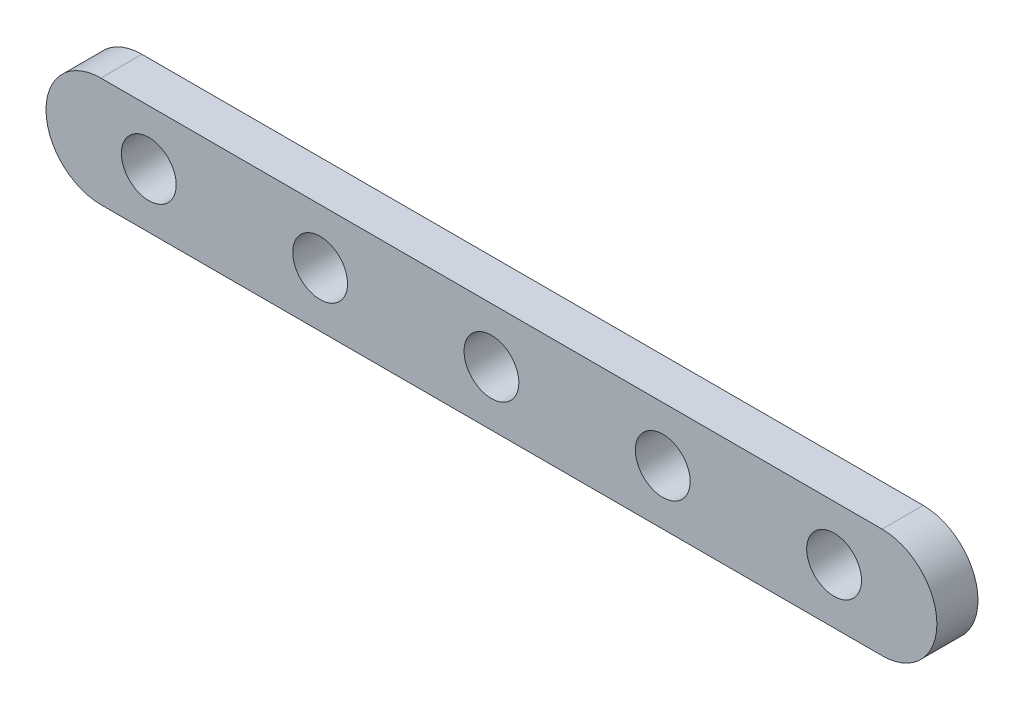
ISO-10303-21;
HEADER;
FILE_DESCRIPTION(('STEP AP214'),'2;1');
FILE_NAME('part.step','',(''),(''),'','','');
FILE_SCHEMA(('AUTOMOTIVE_DESIGN { 1 0 10303 214 1 1 1 1 }'));
ENDSEC;
DATA;
#1=APPLICATION_CONTEXT('core data for automotive mechanical design processes');
#2=APPLICATION_PROTOCOL_DEFINITION('international standard','automotive_design',2000,#1);
#3=PRODUCT_CONTEXT('',#1,'mechanical');
#4=PRODUCT('Part','Part','',(#3));
#5=PRODUCT_RELATED_PRODUCT_CATEGORY('part','',(#4));
#6=PRODUCT_DEFINITION_FORMATION('','',#4);
#7=PRODUCT_DEFINITION_CONTEXT('part definition',#1,'design');
#8=PRODUCT_DEFINITION('design','',#6,#7);
#9=PRODUCT_DEFINITION_SHAPE('','',#8);
#10=(LENGTH_UNIT() NAMED_UNIT(*) SI_UNIT(.MILLI.,.METRE.));
#11=(NAMED_UNIT(*) PLANE_ANGLE_UNIT() SI_UNIT($,.RADIAN.));
#12=(NAMED_UNIT(*) SI_UNIT($,.STERADIAN.) SOLID_ANGLE_UNIT());
#13=UNCERTAINTY_MEASURE_WITH_UNIT(LENGTH_MEASURE(1.E-05),#10,'distance_accuracy_value','');
#14=(GEOMETRIC_REPRESENTATION_CONTEXT(3) GLOBAL_UNCERTAINTY_ASSIGNED_CONTEXT((#13)) GLOBAL_UNIT_ASSIGNED_CONTEXT((#10,
#11,#12)) REPRESENTATION_CONTEXT('',''));
#15=CARTESIAN_POINT('',(0.,0.,0.));
#16=DIRECTION('',(0.,0.,1.));
#17=DIRECTION('',(1.,0.,0.));
#18=AXIS2_PLACEMENT_3D('',#15,#16,#17);
#19=CARTESIAN_POINT('',(-28.5,0.,3.));
#20=DIRECTION('',(0.,0.,1.));
#21=DIRECTION('',(1.,0.,0.));
#22=AXIS2_PLACEMENT_3D('',#19,#20,#21);
#23=PLANE('',#22);
#24=CARTESIAN_POINT('',(12.5,0.,3.));
#25=DIRECTION('',(0.,0.,1.));
#26=DIRECTION('',(1.,0.,0.));
#27=AXIS2_PLACEMENT_3D('',#24,#25,#26);
#28=CIRCLE('',#27,2.);
#29=CARTESIAN_POINT('',(14.5,0.,3.));
#30=VERTEX_POINT('',#29);
#31=EDGE_CURVE('E126',#30,#30,#28,.T.);
#32=ORIENTED_EDGE('',*,*,#31,.F.);
#33=EDGE_LOOP('',(#32));
#34=FACE_BOUND('',#33,.T.);
#35=CARTESIAN_POINT('',(-12.5,0.,3.));
#36=DIRECTION('',(0.,0.,1.));
#37=DIRECTION('',(1.,0.,0.));
#38=AXIS2_PLACEMENT_3D('',#35,#36,#37);
#39=CIRCLE('',#38,2.);
#40=CARTESIAN_POINT('',(-10.5,0.,3.));
#41=VERTEX_POINT('',#40);
#42=EDGE_CURVE('E114',#41,#41,#39,.T.);
#43=ORIENTED_EDGE('',*,*,#42,.F.);
#44=EDGE_LOOP('',(#43));
#45=FACE_BOUND('',#44,.T.);
#46=CARTESIAN_POINT('',(-28.5,0.,3.));
#47=DIRECTION('',(0.,0.,1.));
#48=DIRECTION('',(1.,0.,0.));
#49=AXIS2_PLACEMENT_3D('',#46,#47,#48);
#50=CIRCLE('',#49,4.);
#51=CARTESIAN_POINT('',(-28.5,3.99999999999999,3.));
#52=VERTEX_POINT('',#51);
#53=CARTESIAN_POINT('',(-28.5,-4.,3.));
#54=VERTEX_POINT('',#53);
#55=EDGE_CURVE('E76',#52,#54,#50,.T.);
#56=ORIENTED_EDGE('',*,*,#55,.T.);
#57=DIRECTION('',(-1.,0.,0.));
#58=VECTOR('',#57,1.);
#59=CARTESIAN_POINT('',(28.5,-4.,3.));
#60=LINE('',#59,#58);
#61=CARTESIAN_POINT('',(28.5,-4.,3.));
#62=VERTEX_POINT('',#61);
#63=EDGE_CURVE('E83',#62,#54,#60,.T.);
#64=ORIENTED_EDGE('',*,*,#63,.F.);
#65=CARTESIAN_POINT('',(28.5,0.,3.));
#66=DIRECTION('',(0.,0.,-1.));
#67=DIRECTION('',(-1.,0.,0.));
#68=AXIS2_PLACEMENT_3D('',#65,#66,#67);
#69=CIRCLE('',#68,3.99999999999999);
#70=CARTESIAN_POINT('',(28.5,3.99999999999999,3.));
#71=VERTEX_POINT('',#70);
#72=EDGE_CURVE('E91',#71,#62,#69,.T.);
#73=ORIENTED_EDGE('',*,*,#72,.F.);
#74=DIRECTION('',(1.,0.,0.));
#75=VECTOR('',#74,1.);
#76=CARTESIAN_POINT('',(-28.5,3.99999999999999,3.));
#77=LINE('',#76,#75);
#78=EDGE_CURVE('E94',#52,#71,#77,.T.);
#79=ORIENTED_EDGE('',*,*,#78,.F.);
#80=EDGE_LOOP('',(#56,#64,#73,#79));
#81=FACE_BOUND('',#80,.T.);
#82=CARTESIAN_POINT('',(-25.,0.,3.));
#83=DIRECTION('',(0.,0.,1.));
#84=DIRECTION('',(1.,0.,0.));
#85=AXIS2_PLACEMENT_3D('',#82,#83,#84);
#86=CIRCLE('',#85,2.);
#87=CARTESIAN_POINT('',(-23.,0.,3.));
#88=VERTEX_POINT('',#87);
#89=EDGE_CURVE('E101',#88,#88,#86,.T.);
#90=ORIENTED_EDGE('',*,*,#89,.F.);
#91=EDGE_LOOP('',(#90));
#92=FACE_BOUND('',#91,.T.);
#93=CARTESIAN_POINT('',(0.,0.,3.));
#94=DIRECTION('',(0.,0.,1.));
#95=DIRECTION('',(1.,0.,0.));
#96=AXIS2_PLACEMENT_3D('',#93,#94,#95);
#97=CIRCLE('',#96,2.);
#98=CARTESIAN_POINT('',(2.,0.,3.));
#99=VERTEX_POINT('',#98);
#100=EDGE_CURVE('E120',#99,#99,#97,.T.);
#101=ORIENTED_EDGE('',*,*,#100,.F.);
#102=EDGE_LOOP('',(#101));
#103=FACE_BOUND('',#102,.T.);
#104=CARTESIAN_POINT('',(25.,0.,3.));
#105=DIRECTION('',(0.,0.,1.));
#106=DIRECTION('',(1.,0.,0.));
#107=AXIS2_PLACEMENT_3D('',#104,#105,#106);
#108=CIRCLE('',#107,2.);
#109=CARTESIAN_POINT('',(27.,0.,3.));
#110=VERTEX_POINT('',#109);
#111=EDGE_CURVE('E132',#110,#110,#108,.T.);
#112=ORIENTED_EDGE('',*,*,#111,.F.);
#113=EDGE_LOOP('',(#112));
#114=FACE_BOUND('',#113,.T.);
#115=ADVANCED_FACE('F35',(#34,#45,#81,#92,#103,#114),#23,.T.);
#116=CARTESIAN_POINT('',(-28.5,0.,0.));
#117=DIRECTION('',(0.,0.,1.));
#118=DIRECTION('',(1.,0.,0.));
#119=AXIS2_PLACEMENT_3D('',#116,#117,#118);
#120=PLANE('',#119);
#121=CARTESIAN_POINT('',(12.5,0.,0.));
#122=DIRECTION('',(0.,0.,1.));
#123=DIRECTION('',(1.,0.,0.));
#124=AXIS2_PLACEMENT_3D('',#121,#122,#123);
#125=CIRCLE('',#124,2.);
#126=CARTESIAN_POINT('',(14.5,0.,0.));
#127=VERTEX_POINT('',#126);
#128=EDGE_CURVE('E129',#127,#127,#125,.T.);
#129=ORIENTED_EDGE('',*,*,#128,.T.);
#130=EDGE_LOOP('',(#129));
#131=FACE_BOUND('',#130,.T.);
#132=CARTESIAN_POINT('',(-12.5,0.,0.));
#133=DIRECTION('',(0.,0.,1.));
#134=DIRECTION('',(1.,0.,0.));
#135=AXIS2_PLACEMENT_3D('',#132,#133,#134);
#136=CIRCLE('',#135,2.);
#137=CARTESIAN_POINT('',(-10.5,0.,0.));
#138=VERTEX_POINT('',#137);
#139=EDGE_CURVE('E117',#138,#138,#136,.T.);
#140=ORIENTED_EDGE('',*,*,#139,.T.);
#141=EDGE_LOOP('',(#140));
#142=FACE_BOUND('',#141,.T.);
#143=CARTESIAN_POINT('',(-28.5,0.,0.));
#144=DIRECTION('',(0.,0.,1.));
#145=DIRECTION('',(1.,0.,0.));
#146=AXIS2_PLACEMENT_3D('',#143,#144,#145);
#147=CIRCLE('',#146,4.);
#148=CARTESIAN_POINT('',(-28.5,3.99999999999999,0.));
#149=VERTEX_POINT('',#148);
#150=CARTESIAN_POINT('',(-28.5,-4.,0.));
#151=VERTEX_POINT('',#150);
#152=EDGE_CURVE('E99',#149,#151,#147,.T.);
#153=ORIENTED_EDGE('',*,*,#152,.F.);
#154=DIRECTION('',(1.,0.,0.));
#155=VECTOR('',#154,1.);
#156=CARTESIAN_POINT('',(-28.5,3.99999999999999,0.));
#157=LINE('',#156,#155);
#158=CARTESIAN_POINT('',(28.5,3.99999999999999,0.));
#159=VERTEX_POINT('',#158);
#160=EDGE_CURVE('E105',#149,#159,#157,.T.);
#161=ORIENTED_EDGE('',*,*,#160,.T.);
#162=CARTESIAN_POINT('',(28.5,0.,0.));
#163=DIRECTION('',(0.,0.,-1.));
#164=DIRECTION('',(-1.,0.,0.));
#165=AXIS2_PLACEMENT_3D('',#162,#163,#164);
#166=CIRCLE('',#165,3.99999999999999);
#167=CARTESIAN_POINT('',(28.5,-4.,0.));
#168=VERTEX_POINT('',#167);
#169=EDGE_CURVE('E103',#159,#168,#166,.T.);
#170=ORIENTED_EDGE('',*,*,#169,.T.);
#171=DIRECTION('',(-1.,0.,0.));
#172=VECTOR('',#171,1.);
#173=CARTESIAN_POINT('',(28.5,-4.,0.));
#174=LINE('',#173,#172);
#175=EDGE_CURVE('E85',#168,#151,#174,.T.);
#176=ORIENTED_EDGE('',*,*,#175,.T.);
#177=EDGE_LOOP('',(#153,#161,#170,#176));
#178=FACE_BOUND('',#177,.T.);
#179=CARTESIAN_POINT('',(-25.,0.,0.));
#180=DIRECTION('',(0.,0.,1.));
#181=DIRECTION('',(1.,0.,0.));
#182=AXIS2_PLACEMENT_3D('',#179,#180,#181);
#183=CIRCLE('',#182,2.);
#184=CARTESIAN_POINT('',(-23.,0.,0.));
#185=VERTEX_POINT('',#184);
#186=EDGE_CURVE('E111',#185,#185,#183,.T.);
#187=ORIENTED_EDGE('',*,*,#186,.T.);
#188=EDGE_LOOP('',(#187));
#189=FACE_BOUND('',#188,.T.);
#190=CARTESIAN_POINT('',(0.,0.,0.));
#191=DIRECTION('',(0.,0.,1.));
#192=DIRECTION('',(1.,0.,0.));
#193=AXIS2_PLACEMENT_3D('',#190,#191,#192);
#194=CIRCLE('',#193,2.);
#195=CARTESIAN_POINT('',(2.,0.,0.));
#196=VERTEX_POINT('',#195);
#197=EDGE_CURVE('E123',#196,#196,#194,.T.);
#198=ORIENTED_EDGE('',*,*,#197,.T.);
#199=EDGE_LOOP('',(#198));
#200=FACE_BOUND('',#199,.T.);
#201=CARTESIAN_POINT('',(25.,0.,0.));
#202=DIRECTION('',(0.,0.,1.));
#203=DIRECTION('',(1.,0.,0.));
#204=AXIS2_PLACEMENT_3D('',#201,#202,#203);
#205=CIRCLE('',#204,2.);
#206=CARTESIAN_POINT('',(27.,0.,0.));
#207=VERTEX_POINT('',#206);
#208=EDGE_CURVE('E135',#207,#207,#205,.T.);
#209=ORIENTED_EDGE('',*,*,#208,.T.);
#210=EDGE_LOOP('',(#209));
#211=FACE_BOUND('',#210,.T.);
#212=ADVANCED_FACE('F145',(#131,#142,#178,#189,#200,#211),#120,.F.);
#213=CARTESIAN_POINT('',(-28.5,0.,3.));
#214=DIRECTION('',(0.,0.,-1.));
#215=DIRECTION('',(-1.,0.,0.));
#216=AXIS2_PLACEMENT_3D('',#213,#214,#215);
#217=CYLINDRICAL_SURFACE('',#216,4.);
#218=ORIENTED_EDGE('',*,*,#152,.T.);
#219=DIRECTION('',(0.,0.,-1.));
#220=VECTOR('',#219,1.);
#221=CARTESIAN_POINT('',(-28.5,-4.,3.));
#222=LINE('',#221,#220);
#223=EDGE_CURVE('E11',#54,#151,#222,.T.);
#224=ORIENTED_EDGE('',*,*,#223,.F.);
#225=ORIENTED_EDGE('',*,*,#55,.F.);
#226=DIRECTION('',(0.,0.,-1.));
#227=VECTOR('',#226,1.);
#228=CARTESIAN_POINT('',(-28.5,3.99999999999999,3.));
#229=LINE('',#228,#227);
#230=EDGE_CURVE('E52',#52,#149,#229,.T.);
#231=ORIENTED_EDGE('',*,*,#230,.T.);
#232=EDGE_LOOP('',(#218,#224,#225,#231));
#233=FACE_BOUND('',#232,.T.);
#234=ADVANCED_FACE('F37',(#233),#217,.T.);
#235=CARTESIAN_POINT('',(28.5,-4.,3.));
#236=DIRECTION('',(0.,-1.,0.));
#237=DIRECTION('',(1.,0.,0.));
#238=AXIS2_PLACEMENT_3D('',#235,#236,#237);
#239=PLANE('',#238);
#240=ORIENTED_EDGE('',*,*,#175,.F.);
#241=DIRECTION('',(0.,0.,-1.));
#242=VECTOR('',#241,1.);
#243=CARTESIAN_POINT('',(28.5,-4.,3.));
#244=LINE('',#243,#242);
#245=EDGE_CURVE('E44',#62,#168,#244,.T.);
#246=ORIENTED_EDGE('',*,*,#245,.F.);
#247=ORIENTED_EDGE('',*,*,#63,.T.);
#248=ORIENTED_EDGE('',*,*,#223,.T.);
#249=EDGE_LOOP('',(#240,#246,#247,#248));
#250=FACE_BOUND('',#249,.T.);
#251=ADVANCED_FACE('F82',(#250),#239,.T.);
#252=CARTESIAN_POINT('',(28.5,0.,3.));
#253=DIRECTION('',(0.,0.,-1.));
#254=DIRECTION('',(-1.,0.,0.));
#255=AXIS2_PLACEMENT_3D('',#252,#253,#254);
#256=CYLINDRICAL_SURFACE('',#255,3.99999999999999);
#257=ORIENTED_EDGE('',*,*,#169,.F.);
#258=DIRECTION('',(0.,0.,-1.));
#259=VECTOR('',#258,1.);
#260=CARTESIAN_POINT('',(28.5,3.99999999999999,3.));
#261=LINE('',#260,#259);
#262=EDGE_CURVE('E65',#71,#159,#261,.T.);
#263=ORIENTED_EDGE('',*,*,#262,.F.);
#264=ORIENTED_EDGE('',*,*,#72,.T.);
#265=ORIENTED_EDGE('',*,*,#245,.T.);
#266=EDGE_LOOP('',(#257,#263,#264,#265));
#267=FACE_BOUND('',#266,.T.);
#268=ADVANCED_FACE('F93',(#267),#256,.T.);
#269=CARTESIAN_POINT('',(-28.5,3.99999999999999,3.));
#270=DIRECTION('',(0.,1.,0.));
#271=DIRECTION('',(-1.,0.,0.));
#272=AXIS2_PLACEMENT_3D('',#269,#270,#271);
#273=PLANE('',#272);
#274=ORIENTED_EDGE('',*,*,#160,.F.);
#275=ORIENTED_EDGE('',*,*,#230,.F.);
#276=ORIENTED_EDGE('',*,*,#78,.T.);
#277=ORIENTED_EDGE('',*,*,#262,.T.);
#278=EDGE_LOOP('',(#274,#275,#276,#277));
#279=FACE_BOUND('',#278,.T.);
#280=ADVANCED_FACE('F159',(#279),#273,.T.);
#281=CARTESIAN_POINT('',(-25.,0.,3.));
#282=DIRECTION('',(0.,0.,-1.));
#283=DIRECTION('',(-1.,0.,0.));
#284=AXIS2_PLACEMENT_3D('',#281,#282,#283);
#285=CYLINDRICAL_SURFACE('',#284,2.);
#286=ORIENTED_EDGE('',*,*,#89,.T.);
#287=EDGE_LOOP('',(#286));
#288=FACE_BOUND('',#287,.T.);
#289=ORIENTED_EDGE('',*,*,#186,.F.);
#290=EDGE_LOOP('',(#289));
#291=FACE_BOUND('',#290,.T.);
#292=ADVANCED_FACE('F156',(#288,#291),#285,.F.);
#293=CARTESIAN_POINT('',(-12.5,0.,3.));
#294=DIRECTION('',(0.,0.,-1.));
#295=DIRECTION('',(-1.,0.,0.));
#296=AXIS2_PLACEMENT_3D('',#293,#294,#295);
#297=CYLINDRICAL_SURFACE('',#296,2.);
#298=ORIENTED_EDGE('',*,*,#42,.T.);
#299=EDGE_LOOP('',(#298));
#300=FACE_BOUND('',#299,.T.);
#301=ORIENTED_EDGE('',*,*,#139,.F.);
#302=EDGE_LOOP('',(#301));
#303=FACE_BOUND('',#302,.T.);
#304=ADVANCED_FACE('F186',(#300,#303),#297,.F.);
#305=CARTESIAN_POINT('',(0.,0.,3.));
#306=DIRECTION('',(0.,0.,-1.));
#307=DIRECTION('',(-1.,0.,0.));
#308=AXIS2_PLACEMENT_3D('',#305,#306,#307);
#309=CYLINDRICAL_SURFACE('',#308,2.);
#310=ORIENTED_EDGE('',*,*,#100,.T.);
#311=EDGE_LOOP('',(#310));
#312=FACE_BOUND('',#311,.T.);
#313=ORIENTED_EDGE('',*,*,#197,.F.);
#314=EDGE_LOOP('',(#313));
#315=FACE_BOUND('',#314,.T.);
#316=ADVANCED_FACE('F181',(#312,#315),#309,.F.);
#317=CARTESIAN_POINT('',(12.5,0.,3.));
#318=DIRECTION('',(0.,0.,-1.));
#319=DIRECTION('',(-1.,0.,0.));
#320=AXIS2_PLACEMENT_3D('',#317,#318,#319);
#321=CYLINDRICAL_SURFACE('',#320,2.);
#322=ORIENTED_EDGE('',*,*,#31,.T.);
#323=EDGE_LOOP('',(#322));
#324=FACE_BOUND('',#323,.T.);
#325=ORIENTED_EDGE('',*,*,#128,.F.);
#326=EDGE_LOOP('',(#325));
#327=FACE_BOUND('',#326,.T.);
#328=ADVANCED_FACE('F176',(#324,#327),#321,.F.);
#329=CARTESIAN_POINT('',(25.,0.,3.));
#330=DIRECTION('',(0.,0.,-1.));
#331=DIRECTION('',(-1.,0.,0.));
#332=AXIS2_PLACEMENT_3D('',#329,#330,#331);
#333=CYLINDRICAL_SURFACE('',#332,2.);
#334=ORIENTED_EDGE('',*,*,#111,.T.);
#335=EDGE_LOOP('',(#334));
#336=FACE_BOUND('',#335,.T.);
#337=ORIENTED_EDGE('',*,*,#208,.F.);
#338=EDGE_LOOP('',(#337));
#339=FACE_BOUND('',#338,.T.);
#340=ADVANCED_FACE('F141',(#336,#339),#333,.F.);
#341=CLOSED_SHELL('',(#115,#212,#234,#251,#268,#280,#292,#304,#316,#328,#340));
#342=MANIFOLD_SOLID_BREP('B2',#341);
#343=ADVANCED_BREP_SHAPE_REPRESENTATION('',(#18,#342),#14);
#344=SHAPE_DEFINITION_REPRESENTATION(#9,#343);
ENDSEC;
END-ISO-10303-21;
